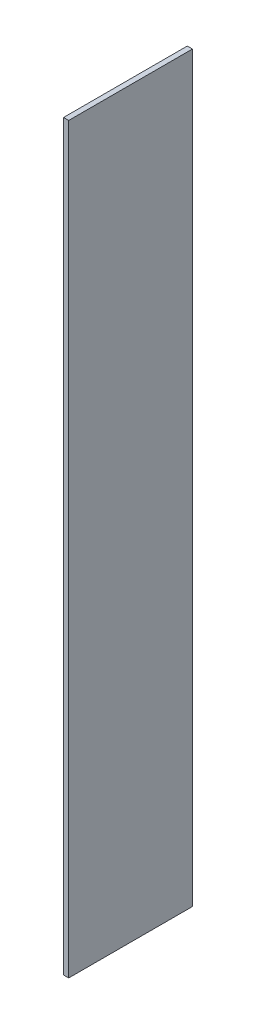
ISO-10303-21;
HEADER;
FILE_DESCRIPTION(('STEP AP214'),'2;1');
FILE_NAME('part.step','',(''),(''),'','','');
FILE_SCHEMA(('AUTOMOTIVE_DESIGN { 1 0 10303 214 1 1 1 1 }'));
ENDSEC;
DATA;
#1=APPLICATION_CONTEXT('core data for automotive mechanical design processes');
#2=APPLICATION_PROTOCOL_DEFINITION('international standard','automotive_design',2000,#1);
#3=PRODUCT_CONTEXT('',#1,'mechanical');
#4=PRODUCT('Part','Part','',(#3));
#5=PRODUCT_RELATED_PRODUCT_CATEGORY('part','',(#4));
#6=PRODUCT_DEFINITION_FORMATION('','',#4);
#7=PRODUCT_DEFINITION_CONTEXT('part definition',#1,'design');
#8=PRODUCT_DEFINITION('design','',#6,#7);
#9=PRODUCT_DEFINITION_SHAPE('','',#8);
#10=(LENGTH_UNIT() NAMED_UNIT(*) SI_UNIT(.MILLI.,.METRE.));
#11=(NAMED_UNIT(*) PLANE_ANGLE_UNIT() SI_UNIT($,.RADIAN.));
#12=(NAMED_UNIT(*) SI_UNIT($,.STERADIAN.) SOLID_ANGLE_UNIT());
#13=UNCERTAINTY_MEASURE_WITH_UNIT(LENGTH_MEASURE(1.E-05),#10,'distance_accuracy_value','');
#14=(GEOMETRIC_REPRESENTATION_CONTEXT(3) GLOBAL_UNCERTAINTY_ASSIGNED_CONTEXT((#13)) GLOBAL_UNIT_ASSIGNED_CONTEXT((#10,
#11,#12)) REPRESENTATION_CONTEXT('',''));
#15=CARTESIAN_POINT('',(0.,0.,0.));
#16=DIRECTION('',(0.,0.,1.));
#17=DIRECTION('',(1.,0.,0.));
#18=AXIS2_PLACEMENT_3D('',#15,#16,#17);
#19=CARTESIAN_POINT('',(0.,0.,152.4));
#20=DIRECTION('',(1.,0.,0.));
#21=DIRECTION('',(0.,0.,-1.));
#22=AXIS2_PLACEMENT_3D('',#19,#20,#21);
#23=PLANE('',#22);
#24=DIRECTION('',(0.,-1.,0.));
#25=VECTOR('',#24,1.);
#26=CARTESIAN_POINT('',(0.,0.,0.));
#27=LINE('',#26,#25);
#28=CARTESIAN_POINT('',(0.,914.4,0.));
#29=VERTEX_POINT('',#28);
#30=CARTESIAN_POINT('',(0.,0.,0.));
#31=VERTEX_POINT('',#30);
#32=EDGE_CURVE('E96',#29,#31,#27,.T.);
#33=ORIENTED_EDGE('',*,*,#32,.T.);
#34=DIRECTION('',(0.,0.,-1.));
#35=VECTOR('',#34,1.);
#36=CARTESIAN_POINT('',(0.,0.,152.4));
#37=LINE('',#36,#35);
#38=CARTESIAN_POINT('',(0.,0.,152.4));
#39=VERTEX_POINT('',#38);
#40=EDGE_CURVE('E11',#39,#31,#37,.T.);
#41=ORIENTED_EDGE('',*,*,#40,.F.);
#42=DIRECTION('',(0.,-1.,0.));
#43=VECTOR('',#42,1.);
#44=CARTESIAN_POINT('',(0.,0.,152.4));
#45=LINE('',#44,#43);
#46=CARTESIAN_POINT('',(0.,914.4,152.4));
#47=VERTEX_POINT('',#46);
#48=EDGE_CURVE('E84',#47,#39,#45,.T.);
#49=ORIENTED_EDGE('',*,*,#48,.F.);
#50=DIRECTION('',(0.,0.,-1.));
#51=VECTOR('',#50,1.);
#52=CARTESIAN_POINT('',(0.,914.4,152.4));
#53=LINE('',#52,#51);
#54=EDGE_CURVE('E92',#47,#29,#53,.T.);
#55=ORIENTED_EDGE('',*,*,#54,.T.);
#56=EDGE_LOOP('',(#33,#41,#49,#55));
#57=FACE_BOUND('',#56,.T.);
#58=ADVANCED_FACE('F33',(#57),#23,.F.);
#59=CARTESIAN_POINT('',(0.,0.,152.4));
#60=DIRECTION('',(0.,1.,0.));
#61=DIRECTION('',(0.,0.,1.));
#62=AXIS2_PLACEMENT_3D('',#59,#60,#61);
#63=PLANE('',#62);
#64=DIRECTION('',(1.,0.,0.));
#65=VECTOR('',#64,1.);
#66=CARTESIAN_POINT('',(0.,0.,0.));
#67=LINE('',#66,#65);
#68=CARTESIAN_POINT('',(6.35,0.,0.));
#69=VERTEX_POINT('',#68);
#70=EDGE_CURVE('E88',#31,#69,#67,.T.);
#71=ORIENTED_EDGE('',*,*,#70,.T.);
#72=DIRECTION('',(0.,0.,-1.));
#73=VECTOR('',#72,1.);
#74=CARTESIAN_POINT('',(6.35,0.,152.4));
#75=LINE('',#74,#73);
#76=CARTESIAN_POINT('',(6.35,0.,152.4));
#77=VERTEX_POINT('',#76);
#78=EDGE_CURVE('E41',#77,#69,#75,.T.);
#79=ORIENTED_EDGE('',*,*,#78,.F.);
#80=DIRECTION('',(1.,0.,0.));
#81=VECTOR('',#80,1.);
#82=CARTESIAN_POINT('',(0.,0.,152.4));
#83=LINE('',#82,#81);
#84=EDGE_CURVE('E79',#39,#77,#83,.T.);
#85=ORIENTED_EDGE('',*,*,#84,.F.);
#86=ORIENTED_EDGE('',*,*,#40,.T.);
#87=EDGE_LOOP('',(#71,#79,#85,#86));
#88=FACE_BOUND('',#87,.T.);
#89=ADVANCED_FACE('F87',(#88),#63,.F.);
#90=CARTESIAN_POINT('',(6.35,0.,152.4));
#91=DIRECTION('',(-1.,0.,0.));
#92=DIRECTION('',(0.,0.,1.));
#93=AXIS2_PLACEMENT_3D('',#90,#91,#92);
#94=PLANE('',#93);
#95=DIRECTION('',(0.,1.,0.));
#96=VECTOR('',#95,1.);
#97=CARTESIAN_POINT('',(6.35,0.,0.));
#98=LINE('',#97,#96);
#99=CARTESIAN_POINT('',(6.35,914.4,0.));
#100=VERTEX_POINT('',#99);
#101=EDGE_CURVE('E66',#69,#100,#98,.T.);
#102=ORIENTED_EDGE('',*,*,#101,.T.);
#103=DIRECTION('',(0.,0.,-1.));
#104=VECTOR('',#103,1.);
#105=CARTESIAN_POINT('',(6.35,914.4,152.4));
#106=LINE('',#105,#104);
#107=CARTESIAN_POINT('',(6.35,914.4,152.4));
#108=VERTEX_POINT('',#107);
#109=EDGE_CURVE('E89',#108,#100,#106,.T.);
#110=ORIENTED_EDGE('',*,*,#109,.F.);
#111=DIRECTION('',(0.,1.,0.));
#112=VECTOR('',#111,1.);
#113=CARTESIAN_POINT('',(6.35,0.,152.4));
#114=LINE('',#113,#112);
#115=EDGE_CURVE('E82',#77,#108,#114,.T.);
#116=ORIENTED_EDGE('',*,*,#115,.F.);
#117=ORIENTED_EDGE('',*,*,#78,.T.);
#118=EDGE_LOOP('',(#102,#110,#116,#117));
#119=FACE_BOUND('',#118,.T.);
#120=ADVANCED_FACE('F90',(#119),#94,.F.);
#121=CARTESIAN_POINT('',(0.,914.4,152.4));
#122=DIRECTION('',(0.,-1.,0.));
#123=DIRECTION('',(0.,0.,-1.));
#124=AXIS2_PLACEMENT_3D('',#121,#122,#123);
#125=PLANE('',#124);
#126=DIRECTION('',(-1.,0.,0.));
#127=VECTOR('',#126,1.);
#128=CARTESIAN_POINT('',(0.,914.4,0.));
#129=LINE('',#128,#127);
#130=EDGE_CURVE('E72',#100,#29,#129,.T.);
#131=ORIENTED_EDGE('',*,*,#130,.T.);
#132=ORIENTED_EDGE('',*,*,#54,.F.);
#133=DIRECTION('',(-1.,0.,0.));
#134=VECTOR('',#133,1.);
#135=CARTESIAN_POINT('',(0.,914.4,152.4));
#136=LINE('',#135,#134);
#137=EDGE_CURVE('E49',#108,#47,#136,.T.);
#138=ORIENTED_EDGE('',*,*,#137,.F.);
#139=ORIENTED_EDGE('',*,*,#109,.T.);
#140=EDGE_LOOP('',(#131,#132,#138,#139));
#141=FACE_BOUND('',#140,.T.);
#142=ADVANCED_FACE('F103',(#141),#125,.F.);
#143=CARTESIAN_POINT('',(0.,0.,152.4));
#144=DIRECTION('',(0.,0.,-1.));
#145=DIRECTION('',(-1.,0.,0.));
#146=AXIS2_PLACEMENT_3D('',#143,#144,#145);
#147=PLANE('',#146);
#148=ORIENTED_EDGE('',*,*,#48,.T.);
#149=ORIENTED_EDGE('',*,*,#84,.T.);
#150=ORIENTED_EDGE('',*,*,#115,.T.);
#151=ORIENTED_EDGE('',*,*,#137,.T.);
#152=EDGE_LOOP('',(#148,#149,#150,#151));
#153=FACE_BOUND('',#152,.T.);
#154=ADVANCED_FACE('F80',(#153),#147,.F.);
#155=CARTESIAN_POINT('',(0.,0.,0.));
#156=DIRECTION('',(0.,0.,-1.));
#157=DIRECTION('',(-1.,0.,0.));
#158=AXIS2_PLACEMENT_3D('',#155,#156,#157);
#159=PLANE('',#158);
#160=ORIENTED_EDGE('',*,*,#32,.F.);
#161=ORIENTED_EDGE('',*,*,#130,.F.);
#162=ORIENTED_EDGE('',*,*,#101,.F.);
#163=ORIENTED_EDGE('',*,*,#70,.F.);
#164=EDGE_LOOP('',(#160,#161,#162,#163));
#165=FACE_BOUND('',#164,.T.);
#166=ADVANCED_FACE('F106',(#165),#159,.T.);
#167=CLOSED_SHELL('',(#58,#89,#120,#142,#154,#166));
#168=MANIFOLD_SOLID_BREP('B2',#167);
#169=ADVANCED_BREP_SHAPE_REPRESENTATION('',(#18,#168),#14);
#170=SHAPE_DEFINITION_REPRESENTATION(#9,#169);
ENDSEC;
END-ISO-10303-21;
